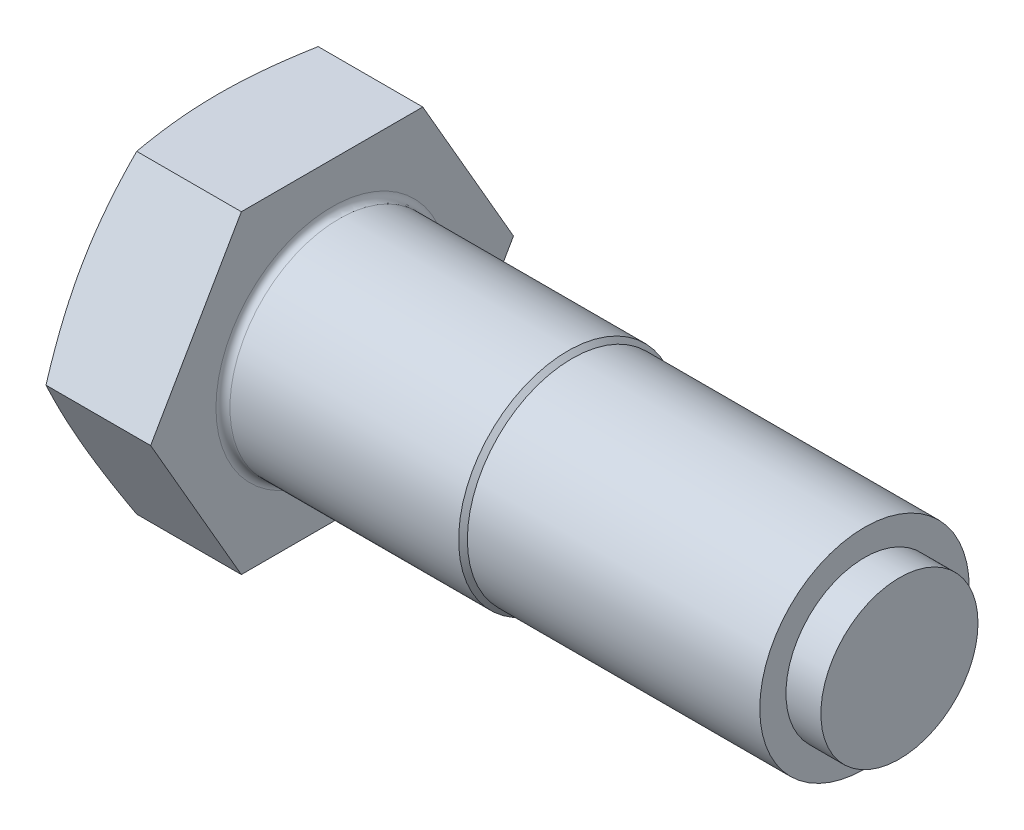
ISO-10303-21;
HEADER;
FILE_DESCRIPTION(('STEP AP214'),'2;1');
FILE_NAME('part.step','',(''),(''),'','','');
FILE_SCHEMA(('AUTOMOTIVE_DESIGN { 1 0 10303 214 1 1 1 1 }'));
ENDSEC;
DATA;
#1=APPLICATION_CONTEXT('core data for automotive mechanical design processes');
#2=APPLICATION_PROTOCOL_DEFINITION('international standard','automotive_design',2000,#1);
#3=PRODUCT_CONTEXT('',#1,'mechanical');
#4=PRODUCT('Part','Part','',(#3));
#5=PRODUCT_RELATED_PRODUCT_CATEGORY('part','',(#4));
#6=PRODUCT_DEFINITION_FORMATION('','',#4);
#7=PRODUCT_DEFINITION_CONTEXT('part definition',#1,'design');
#8=PRODUCT_DEFINITION('design','',#6,#7);
#9=PRODUCT_DEFINITION_SHAPE('','',#8);
#10=(LENGTH_UNIT() NAMED_UNIT(*) SI_UNIT(.MILLI.,.METRE.));
#11=(NAMED_UNIT(*) PLANE_ANGLE_UNIT() SI_UNIT($,.RADIAN.));
#12=(NAMED_UNIT(*) SI_UNIT($,.STERADIAN.) SOLID_ANGLE_UNIT());
#13=UNCERTAINTY_MEASURE_WITH_UNIT(LENGTH_MEASURE(1.E-05),#10,'distance_accuracy_value','');
#14=(GEOMETRIC_REPRESENTATION_CONTEXT(3) GLOBAL_UNCERTAINTY_ASSIGNED_CONTEXT((#13)) GLOBAL_UNIT_ASSIGNED_CONTEXT((#10,
#11,#12)) REPRESENTATION_CONTEXT('',''));
#15=CARTESIAN_POINT('',(0.,0.,0.));
#16=DIRECTION('',(0.,0.,1.));
#17=DIRECTION('',(1.,0.,0.));
#18=AXIS2_PLACEMENT_3D('',#15,#16,#17);
#19=CARTESIAN_POINT('',(13.,-18.,-10.3923048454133));
#20=DIRECTION('',(0.,0.5,0.866025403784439));
#21=DIRECTION('',(0.,-0.866025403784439,0.5));
#22=AXIS2_PLACEMENT_3D('',#19,#20,#21);
#23=PLANE('',#22);
#24=CARTESIAN_POINT('',(1.01355706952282,0.00020000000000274,-20.7847251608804));
#25=CARTESIAN_POINT('',(0.935229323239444,-0.37257014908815,-20.5695062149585));
#26=CARTESIAN_POINT('',(0.860424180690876,-0.745888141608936,-20.3539709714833));
#27=CARTESIAN_POINT('',(0.718634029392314,-1.49367068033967,-19.9222385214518));
#28=CARTESIAN_POINT('',(0.65164976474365,-1.86813533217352,-19.7060412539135));
#29=CARTESIAN_POINT('',(0.463525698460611,-2.99373755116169,-19.0561745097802));
#30=CARTESIAN_POINT('',(0.355325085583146,-3.74656806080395,-18.6215276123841));
#31=CARTESIAN_POINT('',(0.223826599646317,-4.87486909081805,-17.9701027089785));
#32=CARTESIAN_POINT('',(0.185238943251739,-5.2490378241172,-17.7540762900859));
#33=CARTESIAN_POINT('',(0.11860098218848,-5.99807390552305,-17.3216201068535));
#34=CARTESIAN_POINT('',(0.090550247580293,-6.3729412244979,-17.105190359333));
#35=CARTESIAN_POINT('',(0.0454761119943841,-7.12304498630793,-16.6721177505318));
#36=CARTESIAN_POINT('',(0.0284489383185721,-7.49828125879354,-16.4554749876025));
#37=CARTESIAN_POINT('',(0.00571089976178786,-8.24901168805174,-16.0220405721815));
#38=CARTESIAN_POINT('',(0.,-8.62450584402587,-15.8052489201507));
#39=CARTESIAN_POINT('',(0.,-9.37549415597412,-15.3716656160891));
#40=CARTESIAN_POINT('',(0.00571089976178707,-9.75098831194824,-15.1548739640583));
#41=CARTESIAN_POINT('',(0.028448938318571,-10.5017187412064,-14.7214395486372));
#42=CARTESIAN_POINT('',(0.045476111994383,-10.8769550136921,-14.504796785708));
#43=CARTESIAN_POINT('',(0.0905502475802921,-11.6270587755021,-14.0717241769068));
#44=CARTESIAN_POINT('',(0.118600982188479,-12.0019260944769,-13.8552944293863));
#45=CARTESIAN_POINT('',(0.185238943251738,-12.7509621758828,-13.4228382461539));
#46=CARTESIAN_POINT('',(0.223826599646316,-13.1251309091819,-13.2068118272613));
#47=CARTESIAN_POINT('',(0.355325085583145,-14.253431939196,-12.5553869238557));
#48=CARTESIAN_POINT('',(0.46352569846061,-15.0062624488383,-12.1207400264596));
#49=CARTESIAN_POINT('',(0.651649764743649,-16.1318646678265,-11.4708732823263));
#50=CARTESIAN_POINT('',(0.718634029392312,-16.5063293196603,-11.254676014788));
#51=CARTESIAN_POINT('',(0.860424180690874,-17.2541118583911,-10.8229435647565));
#52=CARTESIAN_POINT('',(0.935229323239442,-17.6274298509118,-10.6074083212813));
#53=CARTESIAN_POINT('',(1.01355706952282,-18.0002,-10.3921893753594));
#54=B_SPLINE_CURVE_WITH_KNOTS('',3,(#24,#25,#26,#27,#28,#29,#30,#31,#32,#33,#34,#35,#36,#37,#38,
#39,#40,#41,#42,#43,#44,#45,#46,#47,#48,#49,#50,#51,#52,#53),.UNSPECIFIED.,.F.,.F.,(4,2,2,2,2,2,
2,2,2,2,2,2,2,2,4),(0.,1.31248077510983,2.62508632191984,5.25211195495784,6.55332710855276,
7.85448916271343,9.15520567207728,10.4559181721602,11.7566306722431,13.0573471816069,
14.3585092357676,15.6597243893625,18.2867500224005,19.5993555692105,20.9118363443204),.UNSPECIFIED.);
#55=CARTESIAN_POINT('',(1.01351504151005,0.,-20.7846096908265));
#56=VERTEX_POINT('',#55);
#57=CARTESIAN_POINT('',(0.,-9.,-15.5884572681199));
#58=VERTEX_POINT('',#57);
#59=EDGE_CURVE('E113',#56,#58,#54,.T.);
#60=ORIENTED_EDGE('',*,*,#59,.F.);
#61=DIRECTION('',(-1.,0.,0.));
#62=VECTOR('',#61,1.);
#63=CARTESIAN_POINT('',(13.,0.,-20.7846096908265));
#64=LINE('',#63,#62);
#65=CARTESIAN_POINT('',(13.,0.,-20.7846096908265));
#66=VERTEX_POINT('',#65);
#67=EDGE_CURVE('E142',#66,#56,#64,.T.);
#68=ORIENTED_EDGE('',*,*,#67,.F.);
#69=DIRECTION('',(0.,0.866025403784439,-0.5));
#70=VECTOR('',#69,1.);
#71=CARTESIAN_POINT('',(13.,-18.,-10.3923048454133));
#72=LINE('',#71,#70);
#73=CARTESIAN_POINT('',(13.,-18.,-10.3923048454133));
#74=VERTEX_POINT('',#73);
#75=EDGE_CURVE('E179',#74,#66,#72,.T.);
#76=ORIENTED_EDGE('',*,*,#75,.F.);
#77=DIRECTION('',(-1.,0.,0.));
#78=VECTOR('',#77,1.);
#79=CARTESIAN_POINT('',(13.,-18.,-10.3923048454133));
#80=LINE('',#79,#78);
#81=CARTESIAN_POINT('',(1.01351504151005,-18.,-10.3923048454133));
#82=VERTEX_POINT('',#81);
#83=EDGE_CURVE('E136',#74,#82,#80,.T.);
#84=ORIENTED_EDGE('',*,*,#83,.T.);
#85=EDGE_CURVE('E200',#58,#82,#54,.T.);
#86=ORIENTED_EDGE('',*,*,#85,.F.);
#87=EDGE_LOOP('',(#60,#68,#76,#84,#86));
#88=FACE_BOUND('',#87,.T.);
#89=ADVANCED_FACE('F35',(#88),#23,.F.);
#90=CARTESIAN_POINT('',(13.,0.,-20.7846096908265));
#91=DIRECTION('',(0.,-0.5,0.866025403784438));
#92=DIRECTION('',(0.,-0.866025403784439,-0.5));
#93=AXIS2_PLACEMENT_3D('',#90,#91,#92);
#94=PLANE('',#93);
#95=CARTESIAN_POINT('',(1.01355706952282,18.0002,-10.3921893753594));
#96=CARTESIAN_POINT('',(0.935229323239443,17.6274298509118,-10.6074083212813));
#97=CARTESIAN_POINT('',(0.860424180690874,17.2541118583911,-10.8229435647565));
#98=CARTESIAN_POINT('',(0.718634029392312,16.5063293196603,-11.254676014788));
#99=CARTESIAN_POINT('',(0.651649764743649,16.1318646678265,-11.4708732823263));
#100=CARTESIAN_POINT('',(0.46352569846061,15.0062624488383,-12.1207400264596));
#101=CARTESIAN_POINT('',(0.355325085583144,14.253431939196,-12.5553869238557));
#102=CARTESIAN_POINT('',(0.223826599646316,13.1251309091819,-13.2068118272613));
#103=CARTESIAN_POINT('',(0.185238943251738,12.7509621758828,-13.4228382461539));
#104=CARTESIAN_POINT('',(0.11860098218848,12.0019260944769,-13.8552944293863));
#105=CARTESIAN_POINT('',(0.0905502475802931,11.6270587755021,-14.0717241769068));
#106=CARTESIAN_POINT('',(0.0454761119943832,10.8769550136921,-14.504796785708));
#107=CARTESIAN_POINT('',(0.0284489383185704,10.5017187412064,-14.7214395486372));
#108=CARTESIAN_POINT('',(0.00571089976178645,9.75098831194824,-15.1548739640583));
#109=CARTESIAN_POINT('',(0.,9.37549415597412,-15.3716656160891));
#110=CARTESIAN_POINT('',(0.,8.62450584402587,-15.8052489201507));
#111=CARTESIAN_POINT('',(0.00571089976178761,8.24901168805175,-16.0220405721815));
#112=CARTESIAN_POINT('',(0.0284489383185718,7.49828125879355,-16.4554749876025));
#113=CARTESIAN_POINT('',(0.0454761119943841,7.12304498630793,-16.6721177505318));
#114=CARTESIAN_POINT('',(0.0905502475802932,6.37294122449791,-17.105190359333));
#115=CARTESIAN_POINT('',(0.11860098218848,5.99807390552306,-17.3216201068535));
#116=CARTESIAN_POINT('',(0.185238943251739,5.2490378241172,-17.7540762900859));
#117=CARTESIAN_POINT('',(0.223826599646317,4.87486909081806,-17.9701027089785));
#118=CARTESIAN_POINT('',(0.355325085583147,3.74656806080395,-18.6215276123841));
#119=CARTESIAN_POINT('',(0.463525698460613,2.99373755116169,-19.0561745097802));
#120=CARTESIAN_POINT('',(0.651649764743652,1.86813533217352,-19.7060412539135));
#121=CARTESIAN_POINT('',(0.718634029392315,1.49367068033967,-19.9222385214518));
#122=CARTESIAN_POINT('',(0.860424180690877,0.745888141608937,-20.3539709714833));
#123=CARTESIAN_POINT('',(0.935229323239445,0.372570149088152,-20.5695062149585));
#124=CARTESIAN_POINT('',(1.01355706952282,-0.000200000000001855,-20.7847251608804));
#125=B_SPLINE_CURVE_WITH_KNOTS('',3,(#95,#96,#97,#98,#99,#100,#101,#102,#103,#104,#105,#106,
#107,#108,#109,#110,#111,#112,#113,#114,#115,#116,#117,#118,#119,#120,#121,#122,#123,#124),
.UNSPECIFIED.,.F.,.F.,(4,2,2,2,2,2,2,2,2,2,2,2,2,2,4),(0.,1.31248077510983,2.62508632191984,
5.25211195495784,6.55332710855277,7.85448916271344,9.15520567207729,10.4559181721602,
11.7566306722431,13.0573471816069,14.3585092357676,15.6597243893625,18.2867500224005,
19.5993555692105,20.9118363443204),.UNSPECIFIED.);
#126=CARTESIAN_POINT('',(1.01351504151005,18.,-10.3923048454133));
#127=VERTEX_POINT('',#126);
#128=CARTESIAN_POINT('',(0.,9.,-15.5884572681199));
#129=VERTEX_POINT('',#128);
#130=EDGE_CURVE('E252',#127,#129,#125,.T.);
#131=ORIENTED_EDGE('',*,*,#130,.F.);
#132=DIRECTION('',(-1.,0.,0.));
#133=VECTOR('',#132,1.);
#134=CARTESIAN_POINT('',(13.,18.,-10.3923048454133));
#135=LINE('',#134,#133);
#136=CARTESIAN_POINT('',(13.,18.,-10.3923048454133));
#137=VERTEX_POINT('',#136);
#138=EDGE_CURVE('E133',#137,#127,#135,.T.);
#139=ORIENTED_EDGE('',*,*,#138,.F.);
#140=DIRECTION('',(0.,0.866025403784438,0.5));
#141=VECTOR('',#140,1.);
#142=CARTESIAN_POINT('',(13.,0.,-20.7846096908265));
#143=LINE('',#142,#141);
#144=EDGE_CURVE('E182',#66,#137,#143,.T.);
#145=ORIENTED_EDGE('',*,*,#144,.F.);
#146=ORIENTED_EDGE('',*,*,#67,.T.);
#147=EDGE_CURVE('E125',#129,#56,#125,.T.);
#148=ORIENTED_EDGE('',*,*,#147,.F.);
#149=EDGE_LOOP('',(#131,#139,#145,#146,#148));
#150=FACE_BOUND('',#149,.T.);
#151=ADVANCED_FACE('F258',(#150),#94,.F.);
#152=CARTESIAN_POINT('',(13.,18.,-10.3923048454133));
#153=DIRECTION('',(0.,-1.,0.));
#154=DIRECTION('',(0.,0.,-1.));
#155=AXIS2_PLACEMENT_3D('',#152,#153,#154);
#156=PLANE('',#155);
#157=CARTESIAN_POINT('',(5.41582244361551,18.,-27.5151690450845));
#158=CARTESIAN_POINT('',(5.29180215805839,18.,-27.1079824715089));
#159=CARTESIAN_POINT('',(5.16853188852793,18.,-26.7005675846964));
#160=CARTESIAN_POINT('',(4.92365928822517,18.,-25.8852344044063));
#161=CARTESIAN_POINT('',(4.80205696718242,18.,-25.4773161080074));
#162=CARTESIAN_POINT('',(4.43998810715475,18.,-24.2526827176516));
#163=CARTESIAN_POINT('',(4.20227805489,18.,-23.4351493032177));
#164=CARTESIAN_POINT('',(3.73546671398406,18.,-21.7959728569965));
#165=CARTESIAN_POINT('',(3.50638231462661,18.,-20.9743250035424));
#166=CARTESIAN_POINT('',(3.05948461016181,18.,-19.3279732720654));
#167=CARTESIAN_POINT('',(2.84167110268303,18.,-18.5032694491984));
#168=CARTESIAN_POINT('',(2.42271166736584,18.,-16.8604466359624));
#169=CARTESIAN_POINT('',(2.22139334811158,18.,-16.0423718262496));
#170=CARTESIAN_POINT('',(1.83589627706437,18.,-14.4021513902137));
#171=CARTESIAN_POINT('',(1.6517178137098,18.,-13.5800056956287));
#172=CARTESIAN_POINT('',(1.30479477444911,18.,-11.9314594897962));
#173=CARTESIAN_POINT('',(1.14204288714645,18.,-11.1050605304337));
#174=CARTESIAN_POINT('',(0.842928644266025,18.,-9.44746479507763));
#175=CARTESIAN_POINT('',(0.70656540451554,18.,-8.61626818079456));
#176=CARTESIAN_POINT('',(0.479270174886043,18.,-7.04267313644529));
#177=CARTESIAN_POINT('',(0.384958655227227,18.,-6.30076744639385));
#178=CARTESIAN_POINT('',(0.225311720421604,18.,-4.81381892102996));
#179=CARTESIAN_POINT('',(0.159975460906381,18.,-4.06877617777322));
#180=CARTESIAN_POINT('',(0.0614255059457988,18.,-2.5770647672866));
#181=CARTESIAN_POINT('',(0.0281890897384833,18.,-1.8303976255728));
#182=CARTESIAN_POINT('',(-0.0044784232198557,18.,-0.336316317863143));
#183=CARTESIAN_POINT('',(-0.00390975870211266,18.,0.411097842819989));
#184=CARTESIAN_POINT('',(0.0310905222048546,18.,1.90891227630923));
#185=CARTESIAN_POINT('',(0.0656938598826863,18.,2.65930846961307));
#186=CARTESIAN_POINT('',(0.16717103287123,18.,4.15789675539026));
#187=CARTESIAN_POINT('',(0.234045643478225,18.,4.90608879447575));
#188=CARTESIAN_POINT('',(0.396937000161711,18.,6.39989932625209));
#189=CARTESIAN_POINT('',(0.492978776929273,18.,7.14551504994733));
#190=CARTESIAN_POINT('',(0.710308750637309,18.,8.63301636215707));
#191=CARTESIAN_POINT('',(0.831597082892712,18.,9.37490193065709));
#192=CARTESIAN_POINT('',(1.1024521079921,18.,10.8939822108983));
#193=CARTESIAN_POINT('',(1.25317523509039,18.,11.6709688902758));
#194=CARTESIAN_POINT('',(1.57402044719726,18.,13.2209522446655));
#195=CARTESIAN_POINT('',(1.74414399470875,18.,13.9939486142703));
#196=CARTESIAN_POINT('',(2.10021780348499,18.,15.5365021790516));
#197=CARTESIAN_POINT('',(2.28617266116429,18.,16.3060583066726));
#198=CARTESIAN_POINT('',(2.67088415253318,18.,17.8419287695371));
#199=CARTESIAN_POINT('',(2.86964047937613,18.,18.6082431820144));
#200=CARTESIAN_POINT('',(3.27782395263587,18.,20.139068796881));
#201=CARTESIAN_POINT('',(3.48726447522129,18.,20.9035764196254));
#202=CARTESIAN_POINT('',(3.91466536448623,18.,22.4302031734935));
#203=CARTESIAN_POINT('',(4.1326257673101,18.,23.1923222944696));
#204=CARTESIAN_POINT('',(4.57550689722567,18.,24.7143923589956));
#205=CARTESIAN_POINT('',(4.80042645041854,18.,25.4743436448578));
#206=CARTESIAN_POINT('',(5.25605194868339,18.,26.9925048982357));
#207=CARTESIAN_POINT('',(5.48675788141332,18.,27.7507148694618));
#208=CARTESIAN_POINT('',(5.95041678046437,18.,29.2572852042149));
#209=CARTESIAN_POINT('',(6.18331680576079,18.,30.0056618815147));
#210=CARTESIAN_POINT('',(6.65308922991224,18.,31.5011682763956));
#211=CARTESIAN_POINT('',(6.88996164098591,18.,32.2482979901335));
#212=CARTESIAN_POINT('',(7.60561553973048,18.,34.4881493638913));
#213=CARTESIAN_POINT('',(8.08941377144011,18.,35.9792689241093));
#214=CARTESIAN_POINT('',(8.82151197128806,18.,38.2107066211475));
#215=CARTESIAN_POINT('',(9.06613879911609,18.,38.9522359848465));
#216=CARTESIAN_POINT('',(9.55750817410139,18.,40.4345945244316));
#217=CARTESIAN_POINT('',(9.80425072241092,18.,41.1754236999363));
#218=CARTESIAN_POINT('',(10.2995471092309,18.,42.6564083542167));
#219=CARTESIAN_POINT('',(10.5481007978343,18.,43.3965638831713));
#220=CARTESIAN_POINT('',(11.0468164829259,18.,44.8763309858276));
#221=CARTESIAN_POINT('',(11.2969784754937,18.,45.6159425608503));
#222=CARTESIAN_POINT('',(11.5478337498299,18.,46.355318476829));
#223=B_SPLINE_CURVE_WITH_KNOTS('',3,(#157,#158,#159,#160,#161,#162,#163,#164,#165,#166,#167,
#168,#169,#170,#171,#172,#173,#174,#175,#176,#177,#178,#179,#180,#181,#182,#183,#184,#185,#186,
#187,#188,#189,#190,#191,#192,#193,#194,#195,#196,#197,#198,#199,#200,#201,#202,#203,#204,#205,
#206,#207,#208,#209,#210,#211,#212,#213,#214,#215,#216,#217,#218,#219,#220,#221,#222),
.UNSPECIFIED.,.F.,.F.,(4,2,2,2,2,2,2,2,2,2,2,2,2,2,2,2,2,2,2,2,2,2,2,2,2,2,2,2,2,2,2,2,4),(0.,
1.27696278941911,2.55393302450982,5.10806226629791,7.6669568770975,10.2258055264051,
12.7531049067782,15.280446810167,17.8069240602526,20.3333166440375,22.576452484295,
24.8195229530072,27.0610045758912,29.3024703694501,31.555303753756,33.8081912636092,
36.0630176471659,38.3178561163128,40.6919643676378,43.0662517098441,45.4412307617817,
47.8161529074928,50.1941250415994,52.5721072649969,54.9496905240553,57.3272687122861,
59.6785935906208,62.0299257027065,66.7327919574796,69.0753047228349,71.4178187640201,
73.7601410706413,76.1024576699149),.UNSPECIFIED.);
#224=CARTESIAN_POINT('',(1.01351504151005,18.,10.3923048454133));
#225=VERTEX_POINT('',#224);
#226=CARTESIAN_POINT('',(0.,18.,0.));
#227=VERTEX_POINT('',#226);
#228=EDGE_CURVE('E50',#225,#227,#223,.F.);
#229=ORIENTED_EDGE('',*,*,#228,.F.);
#230=DIRECTION('',(-1.,0.,0.));
#231=VECTOR('',#230,1.);
#232=CARTESIAN_POINT('',(13.,18.,10.3923048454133));
#233=LINE('',#232,#231);
#234=CARTESIAN_POINT('',(13.,18.,10.3923048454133));
#235=VERTEX_POINT('',#234);
#236=EDGE_CURVE('E130',#235,#225,#233,.T.);
#237=ORIENTED_EDGE('',*,*,#236,.F.);
#238=DIRECTION('',(0.,0.,1.));
#239=VECTOR('',#238,1.);
#240=CARTESIAN_POINT('',(13.,18.,-10.3923048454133));
#241=LINE('',#240,#239);
#242=EDGE_CURVE('E188',#137,#235,#241,.T.);
#243=ORIENTED_EDGE('',*,*,#242,.F.);
#244=ORIENTED_EDGE('',*,*,#138,.T.);
#245=EDGE_CURVE('E253',#227,#127,#223,.F.);
#246=ORIENTED_EDGE('',*,*,#245,.F.);
#247=EDGE_LOOP('',(#229,#237,#243,#244,#246));
#248=FACE_BOUND('',#247,.T.);
#249=ADVANCED_FACE('F261',(#248),#156,.F.);
#250=CARTESIAN_POINT('',(13.,18.,10.3923048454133));
#251=DIRECTION('',(0.,-0.5,-0.866025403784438));
#252=DIRECTION('',(0.,0.866025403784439,-0.5));
#253=AXIS2_PLACEMENT_3D('',#250,#251,#252);
#254=PLANE('',#253);
#255=CARTESIAN_POINT('',(1.01355706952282,-0.000199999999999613,20.7847251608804));
#256=CARTESIAN_POINT('',(0.935229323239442,0.372570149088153,20.5695062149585));
#257=CARTESIAN_POINT('',(0.860424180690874,0.745888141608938,20.3539709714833));
#258=CARTESIAN_POINT('',(0.718634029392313,1.49367068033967,19.9222385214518));
#259=CARTESIAN_POINT('',(0.651649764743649,1.86813533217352,19.7060412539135));
#260=CARTESIAN_POINT('',(0.46352569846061,2.99373755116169,19.0561745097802));
#261=CARTESIAN_POINT('',(0.355325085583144,3.74656806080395,18.6215276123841));
#262=CARTESIAN_POINT('',(0.223826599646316,4.87486909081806,17.9701027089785));
#263=CARTESIAN_POINT('',(0.185238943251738,5.24903782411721,17.7540762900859));
#264=CARTESIAN_POINT('',(0.11860098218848,5.99807390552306,17.3216201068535));
#265=CARTESIAN_POINT('',(0.0905502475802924,6.37294122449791,17.105190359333));
#266=CARTESIAN_POINT('',(0.0454761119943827,7.12304498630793,16.6721177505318));
#267=CARTESIAN_POINT('',(0.02844893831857,7.49828125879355,16.4554749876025));
#268=CARTESIAN_POINT('',(0.00571089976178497,8.24901168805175,16.0220405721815));
#269=CARTESIAN_POINT('',(0.,8.62450584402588,15.8052489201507));
#270=CARTESIAN_POINT('',(0.,9.37549415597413,15.3716656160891));
#271=CARTESIAN_POINT('',(0.00571089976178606,9.75098831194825,15.1548739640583));
#272=CARTESIAN_POINT('',(0.0284489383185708,10.5017187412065,14.7214395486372));
#273=CARTESIAN_POINT('',(0.0454761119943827,10.8769550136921,14.504796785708));
#274=CARTESIAN_POINT('',(0.0905502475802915,11.6270587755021,14.0717241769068));
#275=CARTESIAN_POINT('',(0.118600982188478,12.0019260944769,13.8552944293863));
#276=CARTESIAN_POINT('',(0.185238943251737,12.7509621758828,13.4228382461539));
#277=CARTESIAN_POINT('',(0.223826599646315,13.1251309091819,13.2068118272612));
#278=CARTESIAN_POINT('',(0.355325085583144,14.253431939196,12.5553869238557));
#279=CARTESIAN_POINT('',(0.46352569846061,15.0062624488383,12.1207400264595));
#280=CARTESIAN_POINT('',(0.651649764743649,16.1318646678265,11.4708732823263));
#281=CARTESIAN_POINT('',(0.718634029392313,16.5063293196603,11.254676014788));
#282=CARTESIAN_POINT('',(0.860424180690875,17.2541118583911,10.8229435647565));
#283=CARTESIAN_POINT('',(0.935229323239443,17.6274298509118,10.6074083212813));
#284=CARTESIAN_POINT('',(1.01355706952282,18.0002,10.3921893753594));
#285=B_SPLINE_CURVE_WITH_KNOTS('',3,(#255,#256,#257,#258,#259,#260,#261,#262,#263,#264,#265,
#266,#267,#268,#269,#270,#271,#272,#273,#274,#275,#276,#277,#278,#279,#280,#281,#282,#283,#284),
.UNSPECIFIED.,.F.,.F.,(4,2,2,2,2,2,2,2,2,2,2,2,2,2,4),(0.,1.31248077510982,2.62508632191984,
5.25211195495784,6.55332710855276,7.85448916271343,9.15520567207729,10.4559181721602,
11.7566306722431,13.0573471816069,14.3585092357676,15.6597243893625,18.2867500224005,
19.5993555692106,20.9118363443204),.UNSPECIFIED.);
#286=CARTESIAN_POINT('',(1.01351504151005,0.,20.7846096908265));
#287=VERTEX_POINT('',#286);
#288=CARTESIAN_POINT('',(0.,9.,15.5884572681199));
#289=VERTEX_POINT('',#288);
#290=EDGE_CURVE('E58',#287,#289,#285,.T.);
#291=ORIENTED_EDGE('',*,*,#290,.F.);
#292=DIRECTION('',(-1.,0.,0.));
#293=VECTOR('',#292,1.);
#294=CARTESIAN_POINT('',(13.,0.,20.7846096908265));
#295=LINE('',#294,#293);
#296=CARTESIAN_POINT('',(13.,0.,20.7846096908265));
#297=VERTEX_POINT('',#296);
#298=EDGE_CURVE('E121',#297,#287,#295,.T.);
#299=ORIENTED_EDGE('',*,*,#298,.F.);
#300=DIRECTION('',(0.,-0.866025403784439,0.5));
#301=VECTOR('',#300,1.);
#302=CARTESIAN_POINT('',(13.,18.,10.3923048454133));
#303=LINE('',#302,#301);
#304=EDGE_CURVE('E190',#235,#297,#303,.T.);
#305=ORIENTED_EDGE('',*,*,#304,.F.);
#306=ORIENTED_EDGE('',*,*,#236,.T.);
#307=EDGE_CURVE('E124',#289,#225,#285,.T.);
#308=ORIENTED_EDGE('',*,*,#307,.F.);
#309=EDGE_LOOP('',(#291,#299,#305,#306,#308));
#310=FACE_BOUND('',#309,.T.);
#311=ADVANCED_FACE('F119',(#310),#254,.F.);
#312=CARTESIAN_POINT('',(13.,0.,20.7846096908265));
#313=DIRECTION('',(0.,0.5,-0.866025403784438));
#314=DIRECTION('',(0.,0.866025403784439,0.5));
#315=AXIS2_PLACEMENT_3D('',#312,#313,#314);
#316=PLANE('',#315);
#317=CARTESIAN_POINT('',(1.01355706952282,-18.0002,10.3921893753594));
#318=CARTESIAN_POINT('',(0.935229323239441,-17.6274298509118,10.6074083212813));
#319=CARTESIAN_POINT('',(0.860424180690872,-17.2541118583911,10.8229435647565));
#320=CARTESIAN_POINT('',(0.71863402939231,-16.5063293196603,11.254676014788));
#321=CARTESIAN_POINT('',(0.651649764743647,-16.1318646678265,11.4708732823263));
#322=CARTESIAN_POINT('',(0.463525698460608,-15.0062624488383,12.1207400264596));
#323=CARTESIAN_POINT('',(0.355325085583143,-14.253431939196,12.5553869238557));
#324=CARTESIAN_POINT('',(0.223826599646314,-13.1251309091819,13.2068118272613));
#325=CARTESIAN_POINT('',(0.185238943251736,-12.7509621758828,13.4228382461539));
#326=CARTESIAN_POINT('',(0.118600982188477,-12.0019260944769,13.8552944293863));
#327=CARTESIAN_POINT('',(0.0905502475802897,-11.6270587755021,14.0717241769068));
#328=CARTESIAN_POINT('',(0.0454761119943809,-10.8769550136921,14.504796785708));
#329=CARTESIAN_POINT('',(0.0284489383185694,-10.5017187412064,14.7214395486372));
#330=CARTESIAN_POINT('',(0.00571089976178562,-9.75098831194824,15.1548739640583));
#331=CARTESIAN_POINT('',(0.,-9.37549415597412,15.3716656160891));
#332=CARTESIAN_POINT('',(0.,-8.62450584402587,15.8052489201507));
#333=CARTESIAN_POINT('',(0.00571089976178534,-8.24901168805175,16.0220405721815));
#334=CARTESIAN_POINT('',(0.0284489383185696,-7.49828125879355,16.4554749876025));
#335=CARTESIAN_POINT('',(0.0454761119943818,-7.12304498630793,16.6721177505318));
#336=CARTESIAN_POINT('',(0.0905502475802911,-6.3729412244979,17.105190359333));
#337=CARTESIAN_POINT('',(0.118600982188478,-5.99807390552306,17.3216201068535));
#338=CARTESIAN_POINT('',(0.185238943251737,-5.2490378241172,17.7540762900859));
#339=CARTESIAN_POINT('',(0.223826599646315,-4.87486909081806,17.9701027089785));
#340=CARTESIAN_POINT('',(0.355325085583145,-3.74656806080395,18.6215276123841));
#341=CARTESIAN_POINT('',(0.46352569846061,-2.99373755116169,19.0561745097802));
#342=CARTESIAN_POINT('',(0.65164976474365,-1.86813533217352,19.7060412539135));
#343=CARTESIAN_POINT('',(0.718634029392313,-1.49367068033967,19.9222385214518));
#344=CARTESIAN_POINT('',(0.860424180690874,-0.745888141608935,20.3539709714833));
#345=CARTESIAN_POINT('',(0.935229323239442,-0.372570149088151,20.5695062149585));
#346=CARTESIAN_POINT('',(1.01355706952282,0.000200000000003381,20.7847251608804));
#347=B_SPLINE_CURVE_WITH_KNOTS('',3,(#317,#318,#319,#320,#321,#322,#323,#324,#325,#326,#327,
#328,#329,#330,#331,#332,#333,#334,#335,#336,#337,#338,#339,#340,#341,#342,#343,#344,#345,#346),
.UNSPECIFIED.,.F.,.F.,(4,2,2,2,2,2,2,2,2,2,2,2,2,2,4),(0.,1.31248077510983,2.62508632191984,
5.25211195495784,6.55332710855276,7.85448916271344,9.15520567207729,10.4559181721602,
11.7566306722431,13.0573471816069,14.3585092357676,15.6597243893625,18.2867500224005,
19.5993555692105,20.9118363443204),.UNSPECIFIED.);
#348=CARTESIAN_POINT('',(1.01351504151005,-18.,10.3923048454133));
#349=VERTEX_POINT('',#348);
#350=CARTESIAN_POINT('',(0.,-9.,15.5884572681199));
#351=VERTEX_POINT('',#350);
#352=EDGE_CURVE('E115',#349,#351,#347,.T.);
#353=ORIENTED_EDGE('',*,*,#352,.F.);
#354=DIRECTION('',(-1.,0.,0.));
#355=VECTOR('',#354,1.);
#356=CARTESIAN_POINT('',(13.,-18.,10.3923048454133));
#357=LINE('',#356,#355);
#358=CARTESIAN_POINT('',(13.,-18.,10.3923048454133));
#359=VERTEX_POINT('',#358);
#360=EDGE_CURVE('E131',#359,#349,#357,.T.);
#361=ORIENTED_EDGE('',*,*,#360,.F.);
#362=DIRECTION('',(0.,-0.866025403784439,-0.5));
#363=VECTOR('',#362,1.);
#364=CARTESIAN_POINT('',(13.,0.,20.7846096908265));
#365=LINE('',#364,#363);
#366=EDGE_CURVE('E129',#297,#359,#365,.T.);
#367=ORIENTED_EDGE('',*,*,#366,.F.);
#368=ORIENTED_EDGE('',*,*,#298,.T.);
#369=EDGE_CURVE('E105',#351,#287,#347,.T.);
#370=ORIENTED_EDGE('',*,*,#369,.F.);
#371=EDGE_LOOP('',(#353,#361,#367,#368,#370));
#372=FACE_BOUND('',#371,.T.);
#373=ADVANCED_FACE('F127',(#372),#316,.F.);
#374=CARTESIAN_POINT('',(13.,-18.,10.3923048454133));
#375=DIRECTION('',(0.,1.,0.));
#376=DIRECTION('',(0.,0.,1.));
#377=AXIS2_PLACEMENT_3D('',#374,#375,#376);
#378=PLANE('',#377);
#379=CARTESIAN_POINT('',(5.41582244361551,-18.,-27.5151690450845));
#380=CARTESIAN_POINT('',(5.29180215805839,-18.,-27.1079824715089));
#381=CARTESIAN_POINT('',(5.16853188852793,-18.,-26.7005675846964));
#382=CARTESIAN_POINT('',(4.92365928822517,-18.,-25.8852344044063));
#383=CARTESIAN_POINT('',(4.80205696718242,-18.,-25.4773161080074));
#384=CARTESIAN_POINT('',(4.43998810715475,-18.,-24.2526827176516));
#385=CARTESIAN_POINT('',(4.20227805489,-18.,-23.4351493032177));
#386=CARTESIAN_POINT('',(3.73546671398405,-18.,-21.7959728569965));
#387=CARTESIAN_POINT('',(3.5063823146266,-18.,-20.9743250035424));
#388=CARTESIAN_POINT('',(3.05948461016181,-18.,-19.3279732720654));
#389=CARTESIAN_POINT('',(2.84167110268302,-18.,-18.5032694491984));
#390=CARTESIAN_POINT('',(2.42271166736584,-18.,-16.8604466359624));
#391=CARTESIAN_POINT('',(2.22139334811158,-18.,-16.0423718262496));
#392=CARTESIAN_POINT('',(1.83589627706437,-18.,-14.4021513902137));
#393=CARTESIAN_POINT('',(1.6517178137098,-18.,-13.5800056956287));
#394=CARTESIAN_POINT('',(1.30479477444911,-18.,-11.9314594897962));
#395=CARTESIAN_POINT('',(1.14204288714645,-18.,-11.1050605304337));
#396=CARTESIAN_POINT('',(0.842928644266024,-18.,-9.44746479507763));
#397=CARTESIAN_POINT('',(0.70656540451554,-18.,-8.61626818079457));
#398=CARTESIAN_POINT('',(0.479270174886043,-18.,-7.0426731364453));
#399=CARTESIAN_POINT('',(0.384958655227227,-18.,-6.30076744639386));
#400=CARTESIAN_POINT('',(0.225311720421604,-18.,-4.81381892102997));
#401=CARTESIAN_POINT('',(0.159975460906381,-18.,-4.06877617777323));
#402=CARTESIAN_POINT('',(0.0614255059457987,-18.,-2.57706476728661));
#403=CARTESIAN_POINT('',(0.0281890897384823,-18.,-1.83039762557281));
#404=CARTESIAN_POINT('',(-0.00447842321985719,-18.,-0.336316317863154));
#405=CARTESIAN_POINT('',(-0.00390975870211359,-18.,0.411097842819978));
#406=CARTESIAN_POINT('',(0.0310905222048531,-18.,1.90891227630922));
#407=CARTESIAN_POINT('',(0.0656938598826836,-18.,2.65930846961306));
#408=CARTESIAN_POINT('',(0.167171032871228,-18.,4.15789675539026));
#409=CARTESIAN_POINT('',(0.234045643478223,-18.,4.90608879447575));
#410=CARTESIAN_POINT('',(0.396937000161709,-18.,6.39989932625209));
#411=CARTESIAN_POINT('',(0.492978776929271,-18.,7.14551504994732));
#412=CARTESIAN_POINT('',(0.710308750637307,-18.,8.63301636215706));
#413=CARTESIAN_POINT('',(0.831597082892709,-18.,9.37490193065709));
#414=CARTESIAN_POINT('',(1.1024521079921,-18.,10.8939822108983));
#415=CARTESIAN_POINT('',(1.25317523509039,-18.,11.6709688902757));
#416=CARTESIAN_POINT('',(1.57402044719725,-18.,13.2209522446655));
#417=CARTESIAN_POINT('',(1.74414399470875,-18.,13.9939486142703));
#418=CARTESIAN_POINT('',(2.10021780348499,-18.,15.5365021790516));
#419=CARTESIAN_POINT('',(2.2861726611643,-18.,16.3060583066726));
#420=CARTESIAN_POINT('',(2.67088415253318,-18.,17.8419287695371));
#421=CARTESIAN_POINT('',(2.86964047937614,-18.,18.6082431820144));
#422=CARTESIAN_POINT('',(3.27782395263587,-18.,20.139068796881));
#423=CARTESIAN_POINT('',(3.48726447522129,-18.,20.9035764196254));
#424=CARTESIAN_POINT('',(3.91466536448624,-18.,22.4302031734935));
#425=CARTESIAN_POINT('',(4.1326257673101,-18.,23.1923222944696));
#426=CARTESIAN_POINT('',(4.57550689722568,-18.,24.7143923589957));
#427=CARTESIAN_POINT('',(4.80042645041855,-18.,25.4743436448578));
#428=CARTESIAN_POINT('',(5.2560519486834,-18.,26.9925048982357));
#429=CARTESIAN_POINT('',(5.48675788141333,-18.,27.7507148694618));
#430=CARTESIAN_POINT('',(5.95041678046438,-18.,29.2572852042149));
#431=CARTESIAN_POINT('',(6.18331680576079,-18.,30.0056618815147));
#432=CARTESIAN_POINT('',(6.65308922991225,-18.,31.5011682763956));
#433=CARTESIAN_POINT('',(6.88996164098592,-18.,32.2482979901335));
#434=CARTESIAN_POINT('',(7.60561553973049,-18.,34.4881493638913));
#435=CARTESIAN_POINT('',(8.08941377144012,-18.,35.9792689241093));
#436=CARTESIAN_POINT('',(8.82151197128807,-18.,38.2107066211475));
#437=CARTESIAN_POINT('',(9.06613879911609,-18.,38.9522359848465));
#438=CARTESIAN_POINT('',(9.55750817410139,-18.,40.4345945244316));
#439=CARTESIAN_POINT('',(9.80425072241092,-18.,41.1754236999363));
#440=CARTESIAN_POINT('',(10.2995471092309,-18.,42.6564083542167));
#441=CARTESIAN_POINT('',(10.5481007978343,-18.,43.3965638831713));
#442=CARTESIAN_POINT('',(11.0468164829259,-18.,44.8763309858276));
#443=CARTESIAN_POINT('',(11.2969784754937,-18.,45.6159425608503));
#444=CARTESIAN_POINT('',(11.5478337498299,-18.,46.355318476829));
#445=B_SPLINE_CURVE_WITH_KNOTS('',3,(#379,#380,#381,#382,#383,#384,#385,#386,#387,#388,#389,
#390,#391,#392,#393,#394,#395,#396,#397,#398,#399,#400,#401,#402,#403,#404,#405,#406,#407,#408,
#409,#410,#411,#412,#413,#414,#415,#416,#417,#418,#419,#420,#421,#422,#423,#424,#425,#426,#427,
#428,#429,#430,#431,#432,#433,#434,#435,#436,#437,#438,#439,#440,#441,#442,#443,#444),
.UNSPECIFIED.,.F.,.F.,(4,2,2,2,2,2,2,2,2,2,2,2,2,2,2,2,2,2,2,2,2,2,2,2,2,2,2,2,2,2,2,2,4),(0.,
1.27696278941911,2.55393302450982,5.10806226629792,7.66695687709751,10.2258055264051,
12.7531049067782,15.280446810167,17.8069240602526,20.3333166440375,22.576452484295,
24.8195229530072,27.0610045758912,29.3024703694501,31.555303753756,33.8081912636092,
36.0630176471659,38.3178561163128,40.6919643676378,43.0662517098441,45.4412307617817,
47.8161529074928,50.1941250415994,52.5721072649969,54.9496905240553,57.3272687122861,
59.6785935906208,62.0299257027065,66.7327919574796,69.0753047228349,71.4178187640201,
73.7601410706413,76.1024576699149),.UNSPECIFIED.);
#446=CARTESIAN_POINT('',(0.,-18.,0.));
#447=VERTEX_POINT('',#446);
#448=EDGE_CURVE('E208',#82,#447,#445,.T.);
#449=ORIENTED_EDGE('',*,*,#448,.F.);
#450=ORIENTED_EDGE('',*,*,#83,.F.);
#451=DIRECTION('',(0.,0.,-1.));
#452=VECTOR('',#451,1.);
#453=CARTESIAN_POINT('',(13.,-18.,10.3923048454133));
#454=LINE('',#453,#452);
#455=EDGE_CURVE('E193',#359,#74,#454,.T.);
#456=ORIENTED_EDGE('',*,*,#455,.F.);
#457=ORIENTED_EDGE('',*,*,#360,.T.);
#458=EDGE_CURVE('E209',#447,#349,#445,.T.);
#459=ORIENTED_EDGE('',*,*,#458,.F.);
#460=EDGE_LOOP('',(#449,#450,#456,#457,#459));
#461=FACE_BOUND('',#460,.T.);
#462=ADVANCED_FACE('F205',(#461),#378,.F.);
#463=CARTESIAN_POINT('',(176.941125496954,0.,0.));
#464=DIRECTION('',(-1.,0.,0.));
#465=DIRECTION('',(0.,0.,1.));
#466=AXIS2_PLACEMENT_3D('',#463,#464,#465);
#467=CYLINDRICAL_SURFACE('',#466,12.);
#468=CARTESIAN_POINT('',(40.5,0.,0.));
#469=DIRECTION('',(1.,0.,0.));
#470=DIRECTION('',(0.,0.,-1.));
#471=AXIS2_PLACEMENT_3D('',#468,#469,#470);
#472=CIRCLE('',#471,12.);
#473=CARTESIAN_POINT('',(40.5,0.,-12.));
#474=VERTEX_POINT('',#473);
#475=EDGE_CURVE('E13',#474,#474,#472,.T.);
#476=ORIENTED_EDGE('',*,*,#475,.T.);
#477=EDGE_LOOP('',(#476));
#478=FACE_BOUND('',#477,.T.);
#479=CARTESIAN_POINT('',(74.,0.,0.));
#480=DIRECTION('',(1.,0.,0.));
#481=DIRECTION('',(0.,0.,-1.));
#482=AXIS2_PLACEMENT_3D('',#479,#480,#481);
#483=CIRCLE('',#482,12.);
#484=CARTESIAN_POINT('',(74.,0.,-12.));
#485=VERTEX_POINT('',#484);
#486=EDGE_CURVE('E146',#485,#485,#483,.T.);
#487=ORIENTED_EDGE('',*,*,#486,.F.);
#488=EDGE_LOOP('',(#487));
#489=FACE_BOUND('',#488,.T.);
#490=ADVANCED_FACE('F273',(#478,#489),#467,.T.);
#491=CARTESIAN_POINT('',(13.,0.,-20.7846096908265));
#492=DIRECTION('',(1.,0.,0.));
#493=DIRECTION('',(0.,0.,-1.));
#494=AXIS2_PLACEMENT_3D('',#491,#492,#493);
#495=PLANE('',#494);
#496=CARTESIAN_POINT('',(13.,0.,0.));
#497=DIRECTION('',(1.,0.,0.));
#498=DIRECTION('',(0.,0.,-1.));
#499=AXIS2_PLACEMENT_3D('',#496,#497,#498);
#500=CIRCLE('',#499,13.3);
#501=CARTESIAN_POINT('',(13.,0.,-13.3));
#502=VERTEX_POINT('',#501);
#503=EDGE_CURVE('E43',#502,#502,#500,.F.);
#504=ORIENTED_EDGE('',*,*,#503,.T.);
#505=EDGE_LOOP('',(#504));
#506=FACE_BOUND('',#505,.T.);
#507=ORIENTED_EDGE('',*,*,#75,.T.);
#508=ORIENTED_EDGE('',*,*,#144,.T.);
#509=ORIENTED_EDGE('',*,*,#242,.T.);
#510=ORIENTED_EDGE('',*,*,#304,.T.);
#511=ORIENTED_EDGE('',*,*,#366,.T.);
#512=ORIENTED_EDGE('',*,*,#455,.T.);
#513=EDGE_LOOP('',(#507,#508,#509,#510,#511,#512));
#514=FACE_BOUND('',#513,.T.);
#515=ADVANCED_FACE('F160',(#506,#514),#495,.T.);
#516=CARTESIAN_POINT('',(40.,0.,0.));
#517=DIRECTION('',(-1.,0.,0.));
#518=DIRECTION('',(0.,0.,1.));
#519=AXIS2_PLACEMENT_3D('',#516,#517,#518);
#520=CYLINDRICAL_SURFACE('',#519,12.5);
#521=CARTESIAN_POINT('',(13.8,0.,0.));
#522=DIRECTION('',(1.,0.,0.));
#523=DIRECTION('',(0.,0.,-1.));
#524=AXIS2_PLACEMENT_3D('',#521,#522,#523);
#525=CIRCLE('',#524,12.5);
#526=CARTESIAN_POINT('',(13.8,0.,-12.5));
#527=VERTEX_POINT('',#526);
#528=EDGE_CURVE('E155',#527,#527,#525,.T.);
#529=ORIENTED_EDGE('',*,*,#528,.T.);
#530=EDGE_LOOP('',(#529));
#531=FACE_BOUND('',#530,.T.);
#532=CARTESIAN_POINT('',(40.,0.,0.));
#533=DIRECTION('',(1.,0.,0.));
#534=DIRECTION('',(0.,0.,-1.));
#535=AXIS2_PLACEMENT_3D('',#532,#533,#534);
#536=CIRCLE('',#535,12.5);
#537=CARTESIAN_POINT('',(40.,0.,-12.5));
#538=VERTEX_POINT('',#537);
#539=EDGE_CURVE('E149',#538,#538,#536,.T.);
#540=ORIENTED_EDGE('',*,*,#539,.F.);
#541=EDGE_LOOP('',(#540));
#542=FACE_BOUND('',#541,.T.);
#543=ADVANCED_FACE('F171',(#531,#542),#520,.T.);
#544=CARTESIAN_POINT('',(74.,0.,0.));
#545=DIRECTION('',(1.,0.,0.));
#546=DIRECTION('',(0.,0.,-1.));
#547=AXIS2_PLACEMENT_3D('',#544,#545,#546);
#548=PLANE('',#547);
#549=CARTESIAN_POINT('',(74.,0.,0.));
#550=DIRECTION('',(1.,0.,0.));
#551=DIRECTION('',(0.,0.,-1.));
#552=AXIS2_PLACEMENT_3D('',#549,#550,#551);
#553=CIRCLE('',#552,9.);
#554=CARTESIAN_POINT('',(74.,0.,-9.));
#555=VERTEX_POINT('',#554);
#556=EDGE_CURVE('E150',#555,#555,#553,.T.);
#557=ORIENTED_EDGE('',*,*,#556,.F.);
#558=EDGE_LOOP('',(#557));
#559=FACE_BOUND('',#558,.T.);
#560=ORIENTED_EDGE('',*,*,#486,.T.);
#561=EDGE_LOOP('',(#560));
#562=FACE_BOUND('',#561,.T.);
#563=ADVANCED_FACE('F174',(#559,#562),#548,.T.);
#564=CARTESIAN_POINT('',(74.,0.,0.));
#565=DIRECTION('',(1.,0.,0.));
#566=DIRECTION('',(0.,0.,-1.));
#567=AXIS2_PLACEMENT_3D('',#564,#565,#566);
#568=CYLINDRICAL_SURFACE('',#567,9.);
#569=ORIENTED_EDGE('',*,*,#556,.T.);
#570=EDGE_LOOP('',(#569));
#571=FACE_BOUND('',#570,.T.);
#572=CARTESIAN_POINT('',(78.,0.,0.));
#573=DIRECTION('',(1.,0.,0.));
#574=DIRECTION('',(0.,0.,-1.));
#575=AXIS2_PLACEMENT_3D('',#572,#573,#574);
#576=CIRCLE('',#575,9.);
#577=CARTESIAN_POINT('',(78.,0.,-9.));
#578=VERTEX_POINT('',#577);
#579=EDGE_CURVE('E416',#578,#578,#576,.T.);
#580=ORIENTED_EDGE('',*,*,#579,.F.);
#581=EDGE_LOOP('',(#580));
#582=FACE_BOUND('',#581,.T.);
#583=ADVANCED_FACE('F233',(#571,#582),#568,.T.);
#584=CARTESIAN_POINT('',(78.,0.,-20.7846096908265));
#585=DIRECTION('',(1.,0.,0.));
#586=DIRECTION('',(0.,0.,-1.));
#587=AXIS2_PLACEMENT_3D('',#584,#585,#586);
#588=PLANE('',#587);
#589=ORIENTED_EDGE('',*,*,#579,.T.);
#590=EDGE_LOOP('',(#589));
#591=FACE_BOUND('',#590,.T.);
#592=ADVANCED_FACE('F313',(#591),#588,.T.);
#593=CARTESIAN_POINT('',(0.,0.,0.));
#594=DIRECTION('',(1.,0.,0.));
#595=DIRECTION('',(0.,0.,-1.));
#596=AXIS2_PLACEMENT_3D('',#593,#594,#595);
#597=CONICAL_SURFACE('',#596,18.,1.22173047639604);
#598=ORIENTED_EDGE('',*,*,#147,.T.);
#599=ORIENTED_EDGE('',*,*,#59,.T.);
#600=CARTESIAN_POINT('',(0.,0.,0.));
#601=DIRECTION('',(1.,0.,0.));
#602=DIRECTION('',(0.,0.,-1.));
#603=AXIS2_PLACEMENT_3D('',#600,#601,#602);
#604=CIRCLE('',#603,18.);
#605=EDGE_CURVE('E145',#58,#129,#604,.T.);
#606=ORIENTED_EDGE('',*,*,#605,.T.);
#607=EDGE_LOOP('',(#598,#599,#606));
#608=FACE_BOUND('',#607,.T.);
#609=ADVANCED_FACE('F307',(#608),#597,.T.);
#610=ORIENTED_EDGE('',*,*,#85,.T.);
#611=ORIENTED_EDGE('',*,*,#448,.T.);
#612=EDGE_CURVE('E153',#447,#58,#604,.T.);
#613=ORIENTED_EDGE('',*,*,#612,.T.);
#614=EDGE_LOOP('',(#610,#611,#613));
#615=FACE_BOUND('',#614,.T.);
#616=ADVANCED_FACE('F312',(#615),#597,.T.);
#617=ORIENTED_EDGE('',*,*,#352,.T.);
#618=EDGE_CURVE('E428',#351,#447,#604,.T.);
#619=ORIENTED_EDGE('',*,*,#618,.T.);
#620=ORIENTED_EDGE('',*,*,#458,.T.);
#621=EDGE_LOOP('',(#617,#619,#620));
#622=FACE_BOUND('',#621,.T.);
#623=ADVANCED_FACE('F231',(#622),#597,.T.);
#624=ORIENTED_EDGE('',*,*,#290,.T.);
#625=EDGE_CURVE('E108',#289,#351,#604,.T.);
#626=ORIENTED_EDGE('',*,*,#625,.T.);
#627=ORIENTED_EDGE('',*,*,#369,.T.);
#628=EDGE_LOOP('',(#624,#626,#627));
#629=FACE_BOUND('',#628,.T.);
#630=ADVANCED_FACE('F106',(#629),#597,.T.);
#631=ORIENTED_EDGE('',*,*,#228,.T.);
#632=CARTESIAN_POINT('',(0.,0.,0.));
#633=DIRECTION('',(-1.,0.,0.));
#634=DIRECTION('',(0.,0.,1.));
#635=AXIS2_PLACEMENT_3D('',#632,#633,#634);
#636=CIRCLE('',#635,18.);
#637=EDGE_CURVE('E212',#289,#227,#636,.T.);
#638=ORIENTED_EDGE('',*,*,#637,.F.);
#639=ORIENTED_EDGE('',*,*,#307,.T.);
#640=EDGE_LOOP('',(#631,#638,#639));
#641=FACE_BOUND('',#640,.T.);
#642=ADVANCED_FACE('F226',(#641),#597,.T.);
#643=ORIENTED_EDGE('',*,*,#245,.T.);
#644=ORIENTED_EDGE('',*,*,#130,.T.);
#645=EDGE_CURVE('E154',#129,#227,#604,.T.);
#646=ORIENTED_EDGE('',*,*,#645,.T.);
#647=EDGE_LOOP('',(#643,#644,#646));
#648=FACE_BOUND('',#647,.T.);
#649=ADVANCED_FACE('F230',(#648),#597,.T.);
#650=CARTESIAN_POINT('',(0.,0.,-20.7846096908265));
#651=DIRECTION('',(1.,0.,0.));
#652=DIRECTION('',(0.,0.,-1.));
#653=AXIS2_PLACEMENT_3D('',#650,#651,#652);
#654=PLANE('',#653);
#655=ORIENTED_EDGE('',*,*,#645,.F.);
#656=ORIENTED_EDGE('',*,*,#605,.F.);
#657=ORIENTED_EDGE('',*,*,#612,.F.);
#658=ORIENTED_EDGE('',*,*,#618,.F.);
#659=ORIENTED_EDGE('',*,*,#625,.F.);
#660=ORIENTED_EDGE('',*,*,#637,.T.);
#661=EDGE_LOOP('',(#655,#656,#657,#658,#659,#660));
#662=FACE_BOUND('',#661,.T.);
#663=ADVANCED_FACE('F167',(#662),#654,.F.);
#664=CARTESIAN_POINT('',(13.8,0.,0.));
#665=DIRECTION('',(1.,0.,0.));
#666=DIRECTION('',(0.,0.,-1.));
#667=AXIS2_PLACEMENT_3D('',#664,#665,#666);
#668=TOROIDAL_SURFACE('',#667,13.3,0.8);
#669=ORIENTED_EDGE('',*,*,#503,.F.);
#670=EDGE_LOOP('',(#669));
#671=FACE_BOUND('',#670,.T.);
#672=ORIENTED_EDGE('',*,*,#528,.F.);
#673=EDGE_LOOP('',(#672));
#674=FACE_BOUND('',#673,.T.);
#675=ADVANCED_FACE('F163',(#671,#674),#668,.F.);
#676=CARTESIAN_POINT('',(40.5,0.,0.));
#677=DIRECTION('',(-1.,0.,0.));
#678=DIRECTION('',(0.,0.,1.));
#679=AXIS2_PLACEMENT_3D('',#676,#677,#678);
#680=CONICAL_SURFACE('',#679,12.,0.785398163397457);
#681=ORIENTED_EDGE('',*,*,#539,.T.);
#682=EDGE_LOOP('',(#681));
#683=FACE_BOUND('',#682,.T.);
#684=ORIENTED_EDGE('',*,*,#475,.F.);
#685=EDGE_LOOP('',(#684));
#686=FACE_BOUND('',#685,.T.);
#687=ADVANCED_FACE('F166',(#683,#686),#680,.T.);
#688=CLOSED_SHELL('',(#89,#151,#249,#311,#373,#462,#490,#515,#543,#563,#583,#592,#609,#616,#623,
#630,#642,#649,#663,#675,#687));
#689=MANIFOLD_SOLID_BREP('B2',#688);
#690=ADVANCED_BREP_SHAPE_REPRESENTATION('',(#18,#689),#14);
#691=SHAPE_DEFINITION_REPRESENTATION(#9,#690);
ENDSEC;
END-ISO-10303-21;
